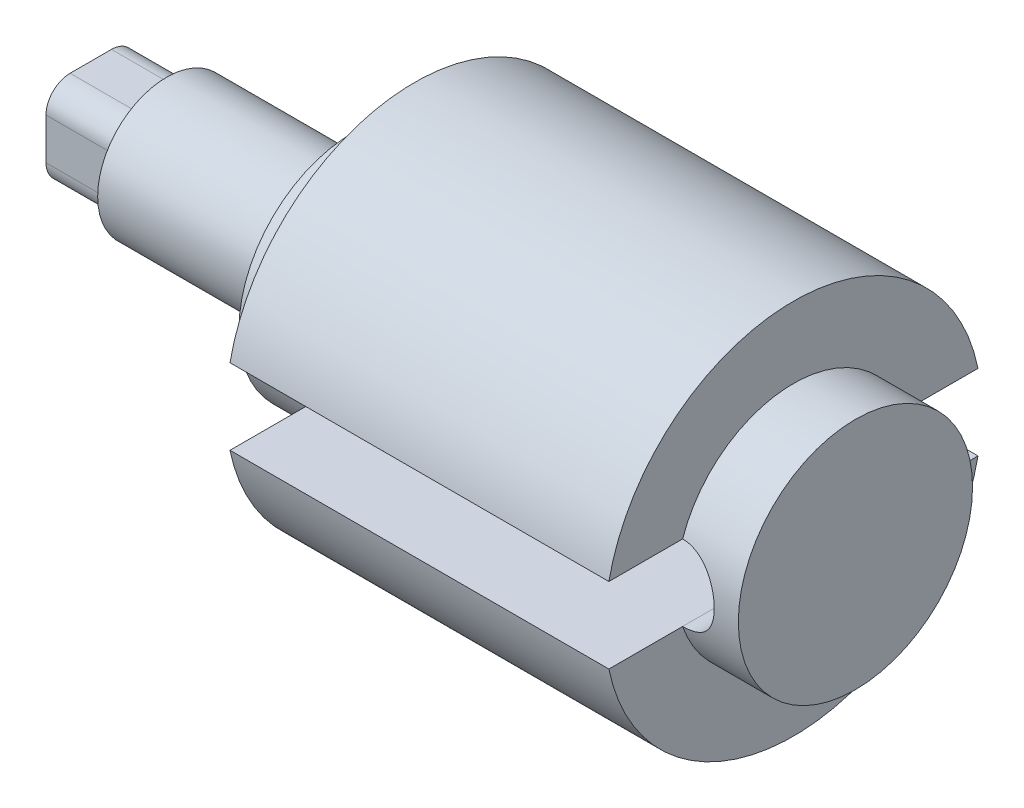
ISO-10303-21;
HEADER;
FILE_DESCRIPTION(('STEP AP214'),'2;1');
FILE_NAME('part.step','',(''),(''),'','','');
FILE_SCHEMA(('AUTOMOTIVE_DESIGN { 1 0 10303 214 1 1 1 1 }'));
ENDSEC;
DATA;
#1=APPLICATION_CONTEXT('core data for automotive mechanical design processes');
#2=APPLICATION_PROTOCOL_DEFINITION('international standard','automotive_design',2000,#1);
#3=PRODUCT_CONTEXT('',#1,'mechanical');
#4=PRODUCT('Part','Part','',(#3));
#5=PRODUCT_RELATED_PRODUCT_CATEGORY('part','',(#4));
#6=PRODUCT_DEFINITION_FORMATION('','',#4);
#7=PRODUCT_DEFINITION_CONTEXT('part definition',#1,'design');
#8=PRODUCT_DEFINITION('design','',#6,#7);
#9=PRODUCT_DEFINITION_SHAPE('','',#8);
#10=(LENGTH_UNIT() NAMED_UNIT(*) SI_UNIT(.MILLI.,.METRE.));
#11=(NAMED_UNIT(*) PLANE_ANGLE_UNIT() SI_UNIT($,.RADIAN.));
#12=(NAMED_UNIT(*) SI_UNIT($,.STERADIAN.) SOLID_ANGLE_UNIT());
#13=UNCERTAINTY_MEASURE_WITH_UNIT(LENGTH_MEASURE(1.E-05),#10,'distance_accuracy_value','');
#14=(GEOMETRIC_REPRESENTATION_CONTEXT(3) GLOBAL_UNCERTAINTY_ASSIGNED_CONTEXT((#13)) GLOBAL_UNIT_ASSIGNED_CONTEXT((#10,
#11,#12)) REPRESENTATION_CONTEXT('',''));
#15=CARTESIAN_POINT('',(0.,0.,0.));
#16=DIRECTION('',(0.,0.,1.));
#17=DIRECTION('',(1.,0.,0.));
#18=AXIS2_PLACEMENT_3D('',#15,#16,#17);
#19=CARTESIAN_POINT('',(0.,0.,0.));
#20=DIRECTION('',(-1.,0.,0.));
#21=DIRECTION('',(0.,0.,1.));
#22=AXIS2_PLACEMENT_3D('',#19,#20,#21);
#23=CYLINDRICAL_SURFACE('',#22,10.);
#24=CARTESIAN_POINT('',(38.,0.,0.));
#25=DIRECTION('',(-1.,0.,0.));
#26=DIRECTION('',(0.,0.,1.));
#27=AXIS2_PLACEMENT_3D('',#24,#25,#26);
#28=CIRCLE('',#27,10.);
#29=CARTESIAN_POINT('',(38.,0.,10.));
#30=VERTEX_POINT('',#29);
#31=EDGE_CURVE('E378',#30,#30,#28,.T.);
#32=ORIENTED_EDGE('',*,*,#31,.T.);
#33=EDGE_LOOP('',(#32));
#34=FACE_BOUND('',#33,.T.);
#35=CARTESIAN_POINT('',(11.,0.,0.));
#36=DIRECTION('',(-1.,0.,0.));
#37=DIRECTION('',(0.,0.,1.));
#38=AXIS2_PLACEMENT_3D('',#35,#36,#37);
#39=CIRCLE('',#38,10.);
#40=CARTESIAN_POINT('',(11.,0.,10.));
#41=VERTEX_POINT('',#40);
#42=EDGE_CURVE('E42',#41,#41,#39,.T.);
#43=ORIENTED_EDGE('',*,*,#42,.F.);
#44=EDGE_LOOP('',(#43));
#45=FACE_BOUND('',#44,.T.);
#46=ADVANCED_FACE('F38',(#34,#45),#23,.T.);
#47=CARTESIAN_POINT('',(47.,16.5,0.));
#48=DIRECTION('',(1.,0.,0.));
#49=DIRECTION('',(0.,0.,-1.));
#50=AXIS2_PLACEMENT_3D('',#47,#48,#49);
#51=PLANE('',#50);
#52=CARTESIAN_POINT('',(47.,0.,0.));
#53=DIRECTION('',(-1.,0.,0.));
#54=DIRECTION('',(0.,0.,1.));
#55=AXIS2_PLACEMENT_3D('',#52,#53,#54);
#56=CIRCLE('',#55,27.35);
#57=CARTESIAN_POINT('',(47.,5.5,26.79127656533));
#58=VERTEX_POINT('',#57);
#59=CARTESIAN_POINT('',(47.,5.5,-26.79127656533));
#60=VERTEX_POINT('',#59);
#61=EDGE_CURVE('E391',#58,#60,#56,.T.);
#62=ORIENTED_EDGE('',*,*,#61,.T.);
#63=DIRECTION('',(0.,0.,1.));
#64=VECTOR('',#63,1.);
#65=CARTESIAN_POINT('',(47.,5.5,-27.35));
#66=LINE('',#65,#64);
#67=CARTESIAN_POINT('',(47.,5.5,-15.556349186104));
#68=VERTEX_POINT('',#67);
#69=EDGE_CURVE('E235',#60,#68,#66,.T.);
#70=ORIENTED_EDGE('',*,*,#69,.T.);
#71=CARTESIAN_POINT('',(47.,0.,0.));
#72=DIRECTION('',(-1.,0.,0.));
#73=DIRECTION('',(0.,0.,1.));
#74=AXIS2_PLACEMENT_3D('',#71,#72,#73);
#75=CIRCLE('',#74,16.5);
#76=CARTESIAN_POINT('',(47.,5.5,15.556349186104));
#77=VERTEX_POINT('',#76);
#78=EDGE_CURVE('E382',#77,#68,#75,.T.);
#79=ORIENTED_EDGE('',*,*,#78,.F.);
#80=EDGE_CURVE('E230',#77,#58,#66,.T.);
#81=ORIENTED_EDGE('',*,*,#80,.T.);
#82=EDGE_LOOP('',(#62,#70,#79,#81));
#83=FACE_BOUND('',#82,.T.);
#84=ADVANCED_FACE('F356',(#83),#51,.F.);
#85=CARTESIAN_POINT('',(0.,0.,0.));
#86=DIRECTION('',(-1.,0.,0.));
#87=DIRECTION('',(0.,0.,1.));
#88=AXIS2_PLACEMENT_3D('',#85,#86,#87);
#89=CYLINDRICAL_SURFACE('',#88,27.35);
#90=CARTESIAN_POINT('',(102.,0.,0.));
#91=DIRECTION('',(-1.,0.,0.));
#92=DIRECTION('',(0.,0.,1.));
#93=AXIS2_PLACEMENT_3D('',#90,#91,#92);
#94=CIRCLE('',#93,27.35);
#95=CARTESIAN_POINT('',(102.,-5.5,-26.79127656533));
#96=VERTEX_POINT('',#95);
#97=CARTESIAN_POINT('',(102.,-5.5,26.79127656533));
#98=VERTEX_POINT('',#97);
#99=EDGE_CURVE('E393',#96,#98,#94,.T.);
#100=ORIENTED_EDGE('',*,*,#99,.T.);
#101=DIRECTION('',(-1.,0.,0.));
#102=VECTOR('',#101,1.);
#103=CARTESIAN_POINT('',(0.,-5.5,26.79127656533));
#104=LINE('',#103,#102);
#105=CARTESIAN_POINT('',(47.,-5.5,26.79127656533));
#106=VERTEX_POINT('',#105);
#107=EDGE_CURVE('E250',#98,#106,#104,.T.);
#108=ORIENTED_EDGE('',*,*,#107,.T.);
#109=CARTESIAN_POINT('',(47.,-5.5,-26.79127656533));
#110=VERTEX_POINT('',#109);
#111=EDGE_CURVE('E388',#110,#106,#56,.T.);
#112=ORIENTED_EDGE('',*,*,#111,.F.);
#113=DIRECTION('',(-1.,0.,0.));
#114=VECTOR('',#113,1.);
#115=CARTESIAN_POINT('',(0.,-5.5,-26.79127656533));
#116=LINE('',#115,#114);
#117=EDGE_CURVE('E247',#110,#96,#116,.F.);
#118=ORIENTED_EDGE('',*,*,#117,.T.);
#119=EDGE_LOOP('',(#100,#108,#112,#118));
#120=FACE_BOUND('',#119,.T.);
#121=ADVANCED_FACE('F361',(#120),#89,.T.);
#122=CARTESIAN_POINT('',(102.,27.35,0.));
#123=DIRECTION('',(-1.,0.,0.));
#124=DIRECTION('',(0.,0.,1.));
#125=AXIS2_PLACEMENT_3D('',#122,#123,#124);
#126=PLANE('',#125);
#127=CARTESIAN_POINT('',(102.,5.5,26.79127656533));
#128=VERTEX_POINT('',#127);
#129=CARTESIAN_POINT('',(102.,5.5,-26.79127656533));
#130=VERTEX_POINT('',#129);
#131=EDGE_CURVE('E392',#128,#130,#94,.T.);
#132=ORIENTED_EDGE('',*,*,#131,.F.);
#133=DIRECTION('',(0.,0.,1.));
#134=VECTOR('',#133,1.);
#135=CARTESIAN_POINT('',(102.,5.5,-27.35));
#136=LINE('',#135,#134);
#137=CARTESIAN_POINT('',(102.,5.5,16.0857079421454));
#138=VERTEX_POINT('',#137);
#139=EDGE_CURVE('E236',#138,#128,#136,.T.);
#140=ORIENTED_EDGE('',*,*,#139,.F.);
#141=CARTESIAN_POINT('',(102.,0.,0.));
#142=DIRECTION('',(-1.,0.,0.));
#143=DIRECTION('',(0.,0.,1.));
#144=AXIS2_PLACEMENT_3D('',#141,#142,#143);
#145=CIRCLE('',#144,17.);
#146=CARTESIAN_POINT('',(102.,5.5,-16.0857079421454));
#147=VERTEX_POINT('',#146);
#148=EDGE_CURVE('E396',#138,#147,#145,.T.);
#149=ORIENTED_EDGE('',*,*,#148,.T.);
#150=EDGE_CURVE('E234',#130,#147,#136,.T.);
#151=ORIENTED_EDGE('',*,*,#150,.F.);
#152=EDGE_LOOP('',(#132,#140,#149,#151));
#153=FACE_BOUND('',#152,.T.);
#154=ADVANCED_FACE('F368',(#153),#126,.F.);
#155=CARTESIAN_POINT('',(38.,10.,0.));
#156=DIRECTION('',(1.,0.,0.));
#157=DIRECTION('',(0.,0.,-1.));
#158=AXIS2_PLACEMENT_3D('',#155,#156,#157);
#159=PLANE('',#158);
#160=ORIENTED_EDGE('',*,*,#31,.F.);
#161=EDGE_LOOP('',(#160));
#162=FACE_BOUND('',#161,.T.);
#163=CARTESIAN_POINT('',(38.,0.,0.));
#164=DIRECTION('',(-1.,0.,0.));
#165=DIRECTION('',(0.,0.,1.));
#166=AXIS2_PLACEMENT_3D('',#163,#164,#165);
#167=CIRCLE('',#166,16.5);
#168=CARTESIAN_POINT('',(38.,0.,16.5));
#169=VERTEX_POINT('',#168);
#170=EDGE_CURVE('E381',#169,#169,#167,.T.);
#171=ORIENTED_EDGE('',*,*,#170,.T.);
#172=EDGE_LOOP('',(#171));
#173=FACE_BOUND('',#172,.T.);
#174=ADVANCED_FACE('F366',(#162,#173),#159,.F.);
#175=CARTESIAN_POINT('',(0.,0.,0.));
#176=DIRECTION('',(-1.,0.,0.));
#177=DIRECTION('',(0.,0.,1.));
#178=AXIS2_PLACEMENT_3D('',#175,#176,#177);
#179=CYLINDRICAL_SURFACE('',#178,16.5);
#180=ORIENTED_EDGE('',*,*,#170,.F.);
#181=EDGE_LOOP('',(#180));
#182=FACE_BOUND('',#181,.T.);
#183=CARTESIAN_POINT('',(47.,-5.5,-15.556349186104));
#184=VERTEX_POINT('',#183);
#185=CARTESIAN_POINT('',(47.,-5.5,15.556349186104));
#186=VERTEX_POINT('',#185);
#187=EDGE_CURVE('E385',#184,#186,#75,.T.);
#188=ORIENTED_EDGE('',*,*,#187,.T.);
#189=CARTESIAN_POINT('',(47.,-5.5,15.556349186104));
#190=CARTESIAN_POINT('',(46.8499471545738,-5.50002133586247,15.5563245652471));
#191=CARTESIAN_POINT('',(46.6999035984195,-5.49386029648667,15.5585194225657));
#192=CARTESIAN_POINT('',(46.4009803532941,-5.46933222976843,15.5671678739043));
#193=CARTESIAN_POINT('',(46.252100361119,-5.45096849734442,15.5736203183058));
#194=CARTESIAN_POINT('',(45.9570036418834,-5.40226565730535,15.5905788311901));
#195=CARTESIAN_POINT('',(45.810780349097,-5.37196206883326,15.6010728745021));
#196=CARTESIAN_POINT('',(45.5215723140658,-5.29966656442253,15.625780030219));
#197=CARTESIAN_POINT('',(45.3785876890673,-5.25767422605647,15.6399932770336));
#198=CARTESIAN_POINT('',(45.0969372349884,-5.16240616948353,15.6716966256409));
#199=CARTESIAN_POINT('',(44.9582680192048,-5.10913956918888,15.6891840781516));
#200=CARTESIAN_POINT('',(44.685956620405,-4.99171292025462,15.7269388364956));
#201=CARTESIAN_POINT('',(44.5523163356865,-4.92754880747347,15.747207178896));
#202=CARTESIAN_POINT('',(44.2908943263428,-4.78880460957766,15.7899530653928));
#203=CARTESIAN_POINT('',(44.1631138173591,-4.71422237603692,15.812431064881));
#204=CARTESIAN_POINT('',(43.9141333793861,-4.55513570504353,15.8589913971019));
#205=CARTESIAN_POINT('',(43.7929358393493,-4.47062770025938,15.8830743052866));
#206=CARTESIAN_POINT('',(43.5537162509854,-4.28910907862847,15.9330697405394));
#207=CARTESIAN_POINT('',(43.4359555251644,-4.19176342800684,15.9590168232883));
#208=CARTESIAN_POINT('',(43.2089734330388,-3.98765769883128,16.0112360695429));
#209=CARTESIAN_POINT('',(43.0997522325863,-3.88089743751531,16.0375082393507));
#210=CARTESIAN_POINT('',(42.890483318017,-3.65857691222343,16.0896815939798));
#211=CARTESIAN_POINT('',(42.7904388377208,-3.5430135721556,16.1155826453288));
#212=CARTESIAN_POINT('',(42.6002437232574,-3.30385821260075,16.1663061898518));
#213=CARTESIAN_POINT('',(42.5100896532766,-3.18026900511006,16.1911290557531));
#214=CARTESIAN_POINT('',(42.337993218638,-2.92238855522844,16.2396831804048));
#215=CARTESIAN_POINT('',(42.2563326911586,-2.78790020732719,16.263367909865));
#216=CARTESIAN_POINT('',(42.1047126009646,-2.51215188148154,16.3082370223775));
#217=CARTESIAN_POINT('',(42.0347483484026,-2.37089464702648,16.329422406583));
#218=CARTESIAN_POINT('',(41.9070589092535,-2.08250391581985,16.3687004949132));
#219=CARTESIAN_POINT('',(41.8493358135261,-1.93536942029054,16.3867926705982));
#220=CARTESIAN_POINT('',(41.7466927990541,-1.636377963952,16.4193442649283));
#221=CARTESIAN_POINT('',(41.7017671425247,-1.48452315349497,16.4338053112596));
#222=CARTESIAN_POINT('',(41.6264416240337,-1.18247918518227,16.4582473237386));
#223=CARTESIAN_POINT('',(41.595595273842,-1.03241240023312,16.4683652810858));
#224=CARTESIAN_POINT('',(41.5465206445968,-0.730072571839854,16.4845351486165));
#225=CARTESIAN_POINT('',(41.5282871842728,-0.577800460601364,16.4905887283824));
#226=CARTESIAN_POINT('',(41.504599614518,-0.272157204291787,16.4984635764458));
#227=CARTESIAN_POINT('',(41.4991454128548,-0.118786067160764,16.5002848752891));
#228=CARTESIAN_POINT('',(41.5010714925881,0.187864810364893,16.4996428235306));
#229=CARTESIAN_POINT('',(41.5084514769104,0.341144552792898,16.4971795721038));
#230=CARTESIAN_POINT('',(41.5354262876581,0.640396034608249,16.4882204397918));
#231=CARTESIAN_POINT('',(41.5545276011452,0.786417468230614,16.4818875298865));
#232=CARTESIAN_POINT('',(41.6043348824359,1.07630563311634,16.465498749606));
#233=CARTESIAN_POINT('',(41.6350447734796,1.2201716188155,16.4554416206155));
#234=CARTESIAN_POINT('',(41.7077860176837,1.50466680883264,16.4318698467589));
#235=CARTESIAN_POINT('',(41.7498135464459,1.64529708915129,16.4183563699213));
#236=CARTESIAN_POINT('',(41.8448610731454,1.92250387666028,16.3882099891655));
#237=CARTESIAN_POINT('',(41.8978852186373,2.05907883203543,16.3715759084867));
#238=CARTESIAN_POINT('',(42.0152454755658,2.32898122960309,16.3353794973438));
#239=CARTESIAN_POINT('',(42.0797173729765,2.46224494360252,16.3157824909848));
#240=CARTESIAN_POINT('',(42.2190400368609,2.72291582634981,16.2743096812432));
#241=CARTESIAN_POINT('',(42.2938943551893,2.85032097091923,16.2524330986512));
#242=CARTESIAN_POINT('',(42.4534491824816,3.0984896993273,16.206951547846));
#243=CARTESIAN_POINT('',(42.5381501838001,3.21925295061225,16.1833464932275));
#244=CARTESIAN_POINT('',(42.7168497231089,3.45345065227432,16.1349923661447));
#245=CARTESIAN_POINT('',(42.8108485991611,3.56688483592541,16.110243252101));
#246=CARTESIAN_POINT('',(43.0122213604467,3.79095881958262,16.0590303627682));
#247=CARTESIAN_POINT('',(43.1200171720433,3.90121389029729,16.0325407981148));
#248=CARTESIAN_POINT('',(43.3444623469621,4.11227043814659,15.9797079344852));
#249=CARTESIAN_POINT('',(43.4611089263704,4.21307486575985,15.9533645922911));
#250=CARTESIAN_POINT('',(43.7026557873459,4.40469091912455,15.901526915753));
#251=CARTESIAN_POINT('',(43.8275617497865,4.49549555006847,15.8760331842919));
#252=CARTESIAN_POINT('',(44.0847386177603,4.66637724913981,15.8266494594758));
#253=CARTESIAN_POINT('',(44.2170066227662,4.74645850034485,15.8027588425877));
#254=CARTESIAN_POINT('',(44.4901950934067,4.89648149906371,15.7569260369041));
#255=CARTESIAN_POINT('',(44.6312167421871,4.96625001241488,15.7350191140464));
#256=CARTESIAN_POINT('',(44.9190362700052,5.09355872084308,15.694270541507));
#257=CARTESIAN_POINT('',(45.0658317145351,5.15110400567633,15.6754276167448));
#258=CARTESIAN_POINT('',(45.3640459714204,5.2534251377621,15.6414332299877));
#259=CARTESIAN_POINT('',(45.5154595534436,5.29821487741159,15.6262777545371));
#260=CARTESIAN_POINT('',(45.8218568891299,5.37465335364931,15.6001514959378));
#261=CARTESIAN_POINT('',(45.976838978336,5.40630809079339,15.5891788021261));
#262=CARTESIAN_POINT('',(46.276258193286,5.45410185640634,15.5725203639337));
#263=CARTESIAN_POINT('',(46.4205055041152,5.4713088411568,15.5664719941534));
#264=CARTESIAN_POINT('',(46.7098315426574,5.49425937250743,15.5583784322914));
#265=CARTESIAN_POINT('',(46.8549089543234,5.50001771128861,15.5563280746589));
#266=CARTESIAN_POINT('',(47.,5.5,15.556349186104));
#267=B_SPLINE_CURVE_WITH_KNOTS('',3,(#189,#190,#191,#192,#193,#194,#195,#196,#197,#198,#199,
#200,#201,#202,#203,#204,#205,#206,#207,#208,#209,#210,#211,#212,#213,#214,#215,#216,#217,#218,
#219,#220,#221,#222,#223,#224,#225,#226,#227,#228,#229,#230,#231,#232,#233,#234,#235,#236,#237,
#238,#239,#240,#241,#242,#243,#244,#245,#246,#247,#248,#249,#250,#251,#252,#253,#254,#255,#256,
#257,#258,#259,#260,#261,#262,#263,#264,#265,#266),.UNSPECIFIED.,.F.,.F.,(4,2,2,2,2,2,2,2,2,2,2,
2,2,2,2,2,2,2,2,2,2,2,2,2,2,2,2,2,2,2,2,2,2,2,2,2,2,2,4),(0.,0.450001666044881,
0.899881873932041,1.34843374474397,1.79700182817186,2.2452085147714,2.69358272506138,
3.14204953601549,3.59067802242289,4.05507433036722,4.51947965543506,4.98404801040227,
5.44845446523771,5.92520043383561,6.40175478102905,6.87839046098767,7.3548121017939,
7.81484633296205,8.27469147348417,8.73453329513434,9.19436447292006,9.63604985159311,
10.0778846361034,10.5195703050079,10.9614228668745,11.4089169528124,11.8565645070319,
12.3042344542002,12.7519206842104,13.2207417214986,13.6894159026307,14.158415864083,
14.627232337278,15.1031976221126,15.5789643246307,16.0542108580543,16.5292400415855,
16.9649240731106,17.4000448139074),.UNSPECIFIED.);
#268=EDGE_CURVE('E267',#186,#77,#267,.T.);
#269=ORIENTED_EDGE('',*,*,#268,.T.);
#270=ORIENTED_EDGE('',*,*,#78,.T.);
#271=CARTESIAN_POINT('',(47.,5.5,-15.556349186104));
#272=CARTESIAN_POINT('',(46.8499471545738,5.50002133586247,-15.5563245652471));
#273=CARTESIAN_POINT('',(46.6999035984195,5.49386029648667,-15.5585194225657));
#274=CARTESIAN_POINT('',(46.4009803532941,5.46933222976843,-15.5671678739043));
#275=CARTESIAN_POINT('',(46.252100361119,5.45096849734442,-15.5736203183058));
#276=CARTESIAN_POINT('',(45.9570036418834,5.40226565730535,-15.5905788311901));
#277=CARTESIAN_POINT('',(45.810780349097,5.37196206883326,-15.6010728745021));
#278=CARTESIAN_POINT('',(45.5215723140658,5.29966656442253,-15.625780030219));
#279=CARTESIAN_POINT('',(45.3785876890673,5.25767422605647,-15.6399932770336));
#280=CARTESIAN_POINT('',(45.0969372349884,5.16240616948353,-15.6716966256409));
#281=CARTESIAN_POINT('',(44.9582680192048,5.10913956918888,-15.6891840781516));
#282=CARTESIAN_POINT('',(44.685956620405,4.99171292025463,-15.7269388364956));
#283=CARTESIAN_POINT('',(44.5523163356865,4.92754880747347,-15.747207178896));
#284=CARTESIAN_POINT('',(44.2908943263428,4.78880460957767,-15.7899530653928));
#285=CARTESIAN_POINT('',(44.1631138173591,4.71422237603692,-15.812431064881));
#286=CARTESIAN_POINT('',(43.9141333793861,4.55513570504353,-15.8589913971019));
#287=CARTESIAN_POINT('',(43.7929358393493,4.47062770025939,-15.8830743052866));
#288=CARTESIAN_POINT('',(43.5537162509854,4.28910907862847,-15.9330697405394));
#289=CARTESIAN_POINT('',(43.4359555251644,4.19176342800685,-15.9590168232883));
#290=CARTESIAN_POINT('',(43.2089734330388,3.98765769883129,-16.0112360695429));
#291=CARTESIAN_POINT('',(43.0997522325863,3.88089743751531,-16.0375082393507));
#292=CARTESIAN_POINT('',(42.890483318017,3.65857691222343,-16.0896815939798));
#293=CARTESIAN_POINT('',(42.7904388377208,3.5430135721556,-16.1155826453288));
#294=CARTESIAN_POINT('',(42.6002437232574,3.30385821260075,-16.1663061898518));
#295=CARTESIAN_POINT('',(42.5100896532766,3.18026900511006,-16.1911290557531));
#296=CARTESIAN_POINT('',(42.337993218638,2.92238855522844,-16.2396831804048));
#297=CARTESIAN_POINT('',(42.2563326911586,2.7879002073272,-16.263367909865));
#298=CARTESIAN_POINT('',(42.1047126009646,2.51215188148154,-16.3082370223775));
#299=CARTESIAN_POINT('',(42.0347483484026,2.37089464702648,-16.329422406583));
#300=CARTESIAN_POINT('',(41.9070589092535,2.08250391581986,-16.3687004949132));
#301=CARTESIAN_POINT('',(41.8493358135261,1.93536942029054,-16.3867926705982));
#302=CARTESIAN_POINT('',(41.7466927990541,1.636377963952,-16.4193442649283));
#303=CARTESIAN_POINT('',(41.7017671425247,1.48452315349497,-16.4338053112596));
#304=CARTESIAN_POINT('',(41.6264416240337,1.18247918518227,-16.4582473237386));
#305=CARTESIAN_POINT('',(41.595595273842,1.03241240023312,-16.4683652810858));
#306=CARTESIAN_POINT('',(41.5465206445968,0.730072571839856,-16.4845351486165));
#307=CARTESIAN_POINT('',(41.5282871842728,0.577800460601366,-16.4905887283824));
#308=CARTESIAN_POINT('',(41.504599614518,0.272157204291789,-16.4984635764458));
#309=CARTESIAN_POINT('',(41.4991454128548,0.118786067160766,-16.5002848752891));
#310=CARTESIAN_POINT('',(41.5010714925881,-0.187864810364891,-16.4996428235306));
#311=CARTESIAN_POINT('',(41.5084514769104,-0.341144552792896,-16.4971795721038));
#312=CARTESIAN_POINT('',(41.5354262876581,-0.640396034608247,-16.4882204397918));
#313=CARTESIAN_POINT('',(41.5545276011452,-0.786417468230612,-16.4818875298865));
#314=CARTESIAN_POINT('',(41.6043348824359,-1.07630563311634,-16.465498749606));
#315=CARTESIAN_POINT('',(41.6350447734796,-1.2201716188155,-16.4554416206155));
#316=CARTESIAN_POINT('',(41.7077860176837,-1.50466680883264,-16.4318698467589));
#317=CARTESIAN_POINT('',(41.7498135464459,-1.64529708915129,-16.4183563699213));
#318=CARTESIAN_POINT('',(41.8448610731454,-1.92250387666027,-16.3882099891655));
#319=CARTESIAN_POINT('',(41.8978852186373,-2.05907883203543,-16.3715759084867));
#320=CARTESIAN_POINT('',(42.0152454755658,-2.32898122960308,-16.3353794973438));
#321=CARTESIAN_POINT('',(42.0797173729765,-2.46224494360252,-16.3157824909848));
#322=CARTESIAN_POINT('',(42.2190400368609,-2.72291582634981,-16.2743096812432));
#323=CARTESIAN_POINT('',(42.2938943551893,-2.85032097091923,-16.2524330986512));
#324=CARTESIAN_POINT('',(42.4534491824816,-3.09848969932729,-16.206951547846));
#325=CARTESIAN_POINT('',(42.5381501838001,-3.21925295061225,-16.1833464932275));
#326=CARTESIAN_POINT('',(42.7168497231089,-3.45345065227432,-16.1349923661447));
#327=CARTESIAN_POINT('',(42.8108485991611,-3.56688483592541,-16.110243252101));
#328=CARTESIAN_POINT('',(43.0122213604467,-3.79095881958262,-16.0590303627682));
#329=CARTESIAN_POINT('',(43.1200171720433,-3.90121389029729,-16.0325407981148));
#330=CARTESIAN_POINT('',(43.3444623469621,-4.11227043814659,-15.9797079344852));
#331=CARTESIAN_POINT('',(43.4611089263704,-4.21307486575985,-15.9533645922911));
#332=CARTESIAN_POINT('',(43.7026557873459,-4.40469091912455,-15.901526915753));
#333=CARTESIAN_POINT('',(43.8275617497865,-4.49549555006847,-15.8760331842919));
#334=CARTESIAN_POINT('',(44.0847386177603,-4.66637724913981,-15.8266494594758));
#335=CARTESIAN_POINT('',(44.2170066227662,-4.74645850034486,-15.8027588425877));
#336=CARTESIAN_POINT('',(44.4901950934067,-4.89648149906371,-15.7569260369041));
#337=CARTESIAN_POINT('',(44.6312167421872,-4.96625001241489,-15.7350191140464));
#338=CARTESIAN_POINT('',(44.9190362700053,-5.09355872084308,-15.694270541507));
#339=CARTESIAN_POINT('',(45.0658317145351,-5.15110400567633,-15.6754276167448));
#340=CARTESIAN_POINT('',(45.3640459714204,-5.25342513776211,-15.6414332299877));
#341=CARTESIAN_POINT('',(45.5154595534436,-5.29821487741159,-15.6262777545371));
#342=CARTESIAN_POINT('',(45.8218568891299,-5.37465335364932,-15.6001514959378));
#343=CARTESIAN_POINT('',(45.976838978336,-5.40630809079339,-15.5891788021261));
#344=CARTESIAN_POINT('',(46.276258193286,-5.45410185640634,-15.5725203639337));
#345=CARTESIAN_POINT('',(46.4205055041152,-5.4713088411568,-15.5664719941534));
#346=CARTESIAN_POINT('',(46.7098315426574,-5.49425937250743,-15.5583784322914));
#347=CARTESIAN_POINT('',(46.8549089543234,-5.5000177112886,-15.5563280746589));
#348=CARTESIAN_POINT('',(47.,-5.5,-15.556349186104));
#349=B_SPLINE_CURVE_WITH_KNOTS('',3,(#271,#272,#273,#274,#275,#276,#277,#278,#279,#280,#281,
#282,#283,#284,#285,#286,#287,#288,#289,#290,#291,#292,#293,#294,#295,#296,#297,#298,#299,#300,
#301,#302,#303,#304,#305,#306,#307,#308,#309,#310,#311,#312,#313,#314,#315,#316,#317,#318,#319,
#320,#321,#322,#323,#324,#325,#326,#327,#328,#329,#330,#331,#332,#333,#334,#335,#336,#337,#338,
#339,#340,#341,#342,#343,#344,#345,#346,#347,#348),.UNSPECIFIED.,.F.,.F.,(4,2,2,2,2,2,2,2,2,2,2,
2,2,2,2,2,2,2,2,2,2,2,2,2,2,2,2,2,2,2,2,2,2,2,2,2,2,2,4),(0.,0.450001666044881,
0.899881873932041,1.34843374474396,1.79700182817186,2.2452085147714,2.69358272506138,
3.14204953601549,3.59067802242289,4.05507433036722,4.51947965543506,4.98404801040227,
5.44845446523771,5.92520043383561,6.40175478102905,6.87839046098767,7.3548121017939,
7.81484633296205,8.27469147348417,8.73453329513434,9.19436447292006,9.63604985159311,
10.0778846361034,10.5195703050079,10.9614228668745,11.4089169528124,11.8565645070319,
12.3042344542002,12.7519206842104,13.2207417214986,13.6894159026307,14.158415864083,
14.627232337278,15.1031976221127,15.5789643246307,16.0542108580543,16.5292400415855,
16.9649240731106,17.4000448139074),.UNSPECIFIED.);
#350=EDGE_CURVE('E259',#68,#184,#349,.T.);
#351=ORIENTED_EDGE('',*,*,#350,.T.);
#352=EDGE_LOOP('',(#188,#269,#270,#351));
#353=FACE_BOUND('',#352,.T.);
#354=ADVANCED_FACE('F272',(#182,#353),#179,.T.);
#355=ORIENTED_EDGE('',*,*,#111,.T.);
#356=DIRECTION('',(0.,0.,1.));
#357=VECTOR('',#356,1.);
#358=CARTESIAN_POINT('',(47.,-5.5,-27.35));
#359=LINE('',#358,#357);
#360=EDGE_CURVE('E244',#186,#106,#359,.T.);
#361=ORIENTED_EDGE('',*,*,#360,.F.);
#362=ORIENTED_EDGE('',*,*,#187,.F.);
#363=EDGE_CURVE('E243',#110,#184,#359,.T.);
#364=ORIENTED_EDGE('',*,*,#363,.F.);
#365=EDGE_LOOP('',(#355,#361,#362,#364));
#366=FACE_BOUND('',#365,.T.);
#367=ADVANCED_FACE('F363',(#366),#51,.F.);
#368=ORIENTED_EDGE('',*,*,#131,.T.);
#369=DIRECTION('',(-1.,0.,0.));
#370=VECTOR('',#369,1.);
#371=CARTESIAN_POINT('',(0.,5.5,-26.79127656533));
#372=LINE('',#371,#370);
#373=EDGE_CURVE('E256',#130,#60,#372,.T.);
#374=ORIENTED_EDGE('',*,*,#373,.T.);
#375=ORIENTED_EDGE('',*,*,#61,.F.);
#376=DIRECTION('',(-1.,0.,0.));
#377=VECTOR('',#376,1.);
#378=CARTESIAN_POINT('',(0.,5.5,26.79127656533));
#379=LINE('',#378,#377);
#380=EDGE_CURVE('E253',#58,#128,#379,.F.);
#381=ORIENTED_EDGE('',*,*,#380,.T.);
#382=EDGE_LOOP('',(#368,#374,#375,#381));
#383=FACE_BOUND('',#382,.T.);
#384=ADVANCED_FACE('F420',(#383),#89,.T.);
#385=ORIENTED_EDGE('',*,*,#99,.F.);
#386=DIRECTION('',(0.,0.,1.));
#387=VECTOR('',#386,1.);
#388=CARTESIAN_POINT('',(102.,-5.5,-27.35));
#389=LINE('',#388,#387);
#390=CARTESIAN_POINT('',(102.,-5.5,-16.0857079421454));
#391=VERTEX_POINT('',#390);
#392=EDGE_CURVE('E239',#96,#391,#389,.T.);
#393=ORIENTED_EDGE('',*,*,#392,.T.);
#394=CARTESIAN_POINT('',(102.,-5.5,16.0857079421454));
#395=VERTEX_POINT('',#394);
#396=EDGE_CURVE('E398',#391,#395,#145,.T.);
#397=ORIENTED_EDGE('',*,*,#396,.T.);
#398=EDGE_CURVE('E240',#395,#98,#389,.T.);
#399=ORIENTED_EDGE('',*,*,#398,.T.);
#400=EDGE_LOOP('',(#385,#393,#397,#399));
#401=FACE_BOUND('',#400,.T.);
#402=ADVANCED_FACE('F294',(#401),#126,.F.);
#403=CARTESIAN_POINT('',(0.,0.,0.));
#404=DIRECTION('',(-1.,0.,0.));
#405=DIRECTION('',(0.,0.,1.));
#406=AXIS2_PLACEMENT_3D('',#403,#404,#405);
#407=CYLINDRICAL_SURFACE('',#406,17.);
#408=ORIENTED_EDGE('',*,*,#148,.F.);
#409=CARTESIAN_POINT('',(102.,5.5,16.0857079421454));
#410=CARTESIAN_POINT('',(102.150325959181,5.50002093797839,16.0856842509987));
#411=CARTESIAN_POINT('',(102.300642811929,5.49383785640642,16.087814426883));
#412=CARTESIAN_POINT('',(102.6001163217,5.46921979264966,16.0962090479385));
#413=CARTESIAN_POINT('',(102.749273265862,5.4507879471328,16.1024724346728));
#414=CARTESIAN_POINT('',(103.044945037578,5.4018974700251,16.1189368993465));
#415=CARTESIAN_POINT('',(103.191466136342,5.37147294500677,16.129126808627));
#416=CARTESIAN_POINT('',(103.481266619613,5.29888316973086,16.1531206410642));
#417=CARTESIAN_POINT('',(103.624545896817,5.25671753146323,16.1669246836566));
#418=CARTESIAN_POINT('',(103.906796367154,5.16103759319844,16.1977223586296));
#419=CARTESIAN_POINT('',(104.045770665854,5.10753170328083,16.2147136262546));
#420=CARTESIAN_POINT('',(104.318649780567,4.98958839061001,16.2513943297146));
#421=CARTESIAN_POINT('',(104.452552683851,4.92514689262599,16.2710847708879));
#422=CARTESIAN_POINT('',(104.845429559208,4.7160787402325,16.3333948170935));
#423=CARTESIAN_POINT('',(105.09570507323,4.55566293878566,16.3792685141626));
#424=CARTESIAN_POINT('',(105.574495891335,4.19125216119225,16.4763475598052));
#425=CARTESIAN_POINT('',(105.80201209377,3.98598648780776,16.5276794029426));
#426=CARTESIAN_POINT('',(106.220111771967,3.54033589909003,16.6288353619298));
#427=CARTESIAN_POINT('',(106.41068878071,3.29994484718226,16.678659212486));
#428=CARTESIAN_POINT('',(106.753921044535,2.78363811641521,16.7726494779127));
#429=CARTESIAN_POINT('',(106.905536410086,2.50699818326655,16.8166479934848));
#430=CARTESIAN_POINT('',(107.159687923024,1.93048524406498,16.8925308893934));
#431=CARTESIAN_POINT('',(107.262238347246,1.63061902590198,16.924418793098));
#432=CARTESIAN_POINT('',(107.411988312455,1.02663397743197,16.9715855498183));
#433=CARTESIAN_POINT('',(107.460898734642,0.722980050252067,16.9873765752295));
#434=CARTESIAN_POINT('',(107.507411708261,0.111385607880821,17.0023841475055));
#435=CARTESIAN_POINT('',(107.505025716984,-0.19655393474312,17.0016043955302));
#436=CARTESIAN_POINT('',(107.450118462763,-0.795887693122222,16.9839098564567));
#437=CARTESIAN_POINT('',(107.399454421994,-1.08747264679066,16.9675927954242));
#438=CARTESIAN_POINT('',(107.25248030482,-1.65775713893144,16.9213982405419));
#439=CARTESIAN_POINT('',(107.156167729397,-1.93645597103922,16.8915200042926));
#440=CARTESIAN_POINT('',(106.919530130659,-2.47719653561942,16.8207876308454));
#441=CARTESIAN_POINT('',(106.778659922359,-2.73898076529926,16.7797984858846));
#442=CARTESIAN_POINT('',(106.457212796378,-3.23585438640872,16.691104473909));
#443=CARTESIAN_POINT('',(106.276625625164,-3.47093686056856,16.6433978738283));
#444=CARTESIAN_POINT('',(105.975223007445,-3.80413707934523,16.5693195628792));
#445=CARTESIAN_POINT('',(105.867013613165,-3.91407691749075,16.5436318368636));
#446=CARTESIAN_POINT('',(105.641737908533,-4.12449575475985,16.4924295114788));
#447=CARTESIAN_POINT('',(105.524674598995,-4.22497793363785,16.4669148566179));
#448=CARTESIAN_POINT('',(105.282326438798,-4.41589799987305,16.4167477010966));
#449=CARTESIAN_POINT('',(105.157035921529,-4.50632884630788,16.3920958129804));
#450=CARTESIAN_POINT('',(104.899125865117,-4.67642152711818,16.3443837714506));
#451=CARTESIAN_POINT('',(104.766509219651,-4.75608757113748,16.3213229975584));
#452=CARTESIAN_POINT('',(104.492874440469,-4.90511773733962,16.2771602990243));
#453=CARTESIAN_POINT('',(104.351765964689,-4.9743254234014,16.2560896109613));
#454=CARTESIAN_POINT('',(104.063848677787,-5.10051191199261,16.2169400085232));
#455=CARTESIAN_POINT('',(103.91704225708,-5.15749577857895,16.198859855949));
#456=CARTESIAN_POINT('',(103.618883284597,-5.2587046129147,16.1662875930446));
#457=CARTESIAN_POINT('',(103.467535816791,-5.3029433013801,16.1517916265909));
#458=CARTESIAN_POINT('',(103.16134641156,-5.37830092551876,16.1268549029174));
#459=CARTESIAN_POINT('',(103.006506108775,-5.40942586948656,16.1164122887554));
#460=CARTESIAN_POINT('',(102.709922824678,-5.45584528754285,16.1007552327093));
#461=CARTESIAN_POINT('',(102.568397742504,-5.47240023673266,16.0951261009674));
#462=CARTESIAN_POINT('',(102.284585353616,-5.49447806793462,16.0875956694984));
#463=CARTESIAN_POINT('',(102.142299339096,-5.50001586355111,16.0856893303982));
#464=CARTESIAN_POINT('',(102.,-5.5,16.0857079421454));
#465=B_SPLINE_CURVE_WITH_KNOTS('',3,(#409,#410,#411,#412,#413,#414,#415,#416,#417,#418,#419,
#420,#421,#422,#423,#424,#425,#426,#427,#428,#429,#430,#431,#432,#433,#434,#435,#436,#437,#438,
#439,#440,#441,#442,#443,#444,#445,#446,#447,#448,#449,#450,#451,#452,#453,#454,#455,#456,#457,
#458,#459,#460,#461,#462,#463,#464),.UNSPECIFIED.,.F.,.F.,(4,2,2,2,2,2,2,2,2,2,2,2,2,2,2,2,2,2,
2,2,2,2,2,2,2,2,2,4),(0.,0.450821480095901,0.901527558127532,1.35096099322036,1.80040928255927,
2.24952541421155,2.69880928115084,3.59695681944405,4.52494155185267,5.45308860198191,
6.40390478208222,7.35444412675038,8.27369432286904,9.19273920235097,10.0777985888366,
10.9629064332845,11.8592926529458,12.7559105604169,13.2246159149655,13.6931631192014,
14.1620364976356,14.6307259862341,15.1058495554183,15.580775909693,16.0551890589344,
16.5293846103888,16.9567174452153,17.3834714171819),.UNSPECIFIED.);
#466=EDGE_CURVE('E12',#138,#395,#465,.T.);
#467=ORIENTED_EDGE('',*,*,#466,.T.);
#468=ORIENTED_EDGE('',*,*,#396,.F.);
#469=CARTESIAN_POINT('',(102.,-5.5,-16.0857079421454));
#470=CARTESIAN_POINT('',(102.150325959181,-5.50002093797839,-16.0856842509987));
#471=CARTESIAN_POINT('',(102.300642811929,-5.49383785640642,-16.087814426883));
#472=CARTESIAN_POINT('',(102.6001163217,-5.46921979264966,-16.0962090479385));
#473=CARTESIAN_POINT('',(102.749273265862,-5.4507879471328,-16.1024724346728));
#474=CARTESIAN_POINT('',(103.044945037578,-5.4018974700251,-16.1189368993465));
#475=CARTESIAN_POINT('',(103.191466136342,-5.37147294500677,-16.129126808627));
#476=CARTESIAN_POINT('',(103.481266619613,-5.29888316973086,-16.1531206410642));
#477=CARTESIAN_POINT('',(103.624545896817,-5.25671753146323,-16.1669246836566));
#478=CARTESIAN_POINT('',(103.906796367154,-5.16103759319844,-16.1977223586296));
#479=CARTESIAN_POINT('',(104.045770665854,-5.10753170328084,-16.2147136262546));
#480=CARTESIAN_POINT('',(104.318649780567,-4.98958839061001,-16.2513943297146));
#481=CARTESIAN_POINT('',(104.452552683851,-4.92514689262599,-16.2710847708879));
#482=CARTESIAN_POINT('',(104.845429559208,-4.7160787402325,-16.3333948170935));
#483=CARTESIAN_POINT('',(105.09570507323,-4.55566293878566,-16.3792685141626));
#484=CARTESIAN_POINT('',(105.574495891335,-4.19125216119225,-16.4763475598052));
#485=CARTESIAN_POINT('',(105.80201209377,-3.98598648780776,-16.5276794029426));
#486=CARTESIAN_POINT('',(106.220111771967,-3.54033589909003,-16.6288353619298));
#487=CARTESIAN_POINT('',(106.41068878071,-3.29994484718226,-16.678659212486));
#488=CARTESIAN_POINT('',(106.753921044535,-2.78363811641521,-16.7726494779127));
#489=CARTESIAN_POINT('',(106.905536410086,-2.50699818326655,-16.8166479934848));
#490=CARTESIAN_POINT('',(107.159687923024,-1.93048524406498,-16.8925308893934));
#491=CARTESIAN_POINT('',(107.262238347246,-1.63061902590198,-16.924418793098));
#492=CARTESIAN_POINT('',(107.411988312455,-1.02663397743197,-16.9715855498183));
#493=CARTESIAN_POINT('',(107.460898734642,-0.722980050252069,-16.9873765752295));
#494=CARTESIAN_POINT('',(107.507411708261,-0.111385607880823,-17.0023841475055));
#495=CARTESIAN_POINT('',(107.505025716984,0.196553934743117,-17.0016043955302));
#496=CARTESIAN_POINT('',(107.450118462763,0.79588769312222,-16.9839098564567));
#497=CARTESIAN_POINT('',(107.399454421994,1.08747264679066,-16.9675927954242));
#498=CARTESIAN_POINT('',(107.25248030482,1.65775713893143,-16.9213982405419));
#499=CARTESIAN_POINT('',(107.156167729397,1.93645597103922,-16.8915200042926));
#500=CARTESIAN_POINT('',(106.919530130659,2.47719653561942,-16.8207876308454));
#501=CARTESIAN_POINT('',(106.778659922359,2.73898076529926,-16.7797984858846));
#502=CARTESIAN_POINT('',(106.457212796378,3.23585438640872,-16.691104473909));
#503=CARTESIAN_POINT('',(106.276625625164,3.47093686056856,-16.6433978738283));
#504=CARTESIAN_POINT('',(105.975223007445,3.80413707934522,-16.5693195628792));
#505=CARTESIAN_POINT('',(105.867013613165,3.91407691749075,-16.5436318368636));
#506=CARTESIAN_POINT('',(105.641737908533,4.12449575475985,-16.4924295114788));
#507=CARTESIAN_POINT('',(105.524674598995,4.22497793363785,-16.4669148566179));
#508=CARTESIAN_POINT('',(105.282326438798,4.41589799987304,-16.4167477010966));
#509=CARTESIAN_POINT('',(105.157035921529,4.50632884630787,-16.3920958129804));
#510=CARTESIAN_POINT('',(104.899125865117,4.67642152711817,-16.3443837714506));
#511=CARTESIAN_POINT('',(104.766509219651,4.75608757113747,-16.3213229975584));
#512=CARTESIAN_POINT('',(104.492874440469,4.90511773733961,-16.2771602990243));
#513=CARTESIAN_POINT('',(104.351765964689,4.9743254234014,-16.2560896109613));
#514=CARTESIAN_POINT('',(104.063848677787,5.10051191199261,-16.2169400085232));
#515=CARTESIAN_POINT('',(103.91704225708,5.15749577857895,-16.198859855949));
#516=CARTESIAN_POINT('',(103.618883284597,5.2587046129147,-16.1662875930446));
#517=CARTESIAN_POINT('',(103.467535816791,5.3029433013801,-16.1517916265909));
#518=CARTESIAN_POINT('',(103.16134641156,5.37830092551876,-16.1268549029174));
#519=CARTESIAN_POINT('',(103.006506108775,5.40942586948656,-16.1164122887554));
#520=CARTESIAN_POINT('',(102.709922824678,5.45584528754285,-16.1007552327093));
#521=CARTESIAN_POINT('',(102.568397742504,5.47240023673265,-16.0951261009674));
#522=CARTESIAN_POINT('',(102.284585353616,5.49447806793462,-16.0875956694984));
#523=CARTESIAN_POINT('',(102.142299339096,5.50001586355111,-16.0856893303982));
#524=CARTESIAN_POINT('',(102.,5.5,-16.0857079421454));
#525=B_SPLINE_CURVE_WITH_KNOTS('',3,(#469,#470,#471,#472,#473,#474,#475,#476,#477,#478,#479,
#480,#481,#482,#483,#484,#485,#486,#487,#488,#489,#490,#491,#492,#493,#494,#495,#496,#497,#498,
#499,#500,#501,#502,#503,#504,#505,#506,#507,#508,#509,#510,#511,#512,#513,#514,#515,#516,#517,
#518,#519,#520,#521,#522,#523,#524),.UNSPECIFIED.,.F.,.F.,(4,2,2,2,2,2,2,2,2,2,2,2,2,2,2,2,2,2,
2,2,2,2,2,2,2,2,2,4),(0.,0.450821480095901,0.901527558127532,1.35096099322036,1.80040928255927,
2.24952541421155,2.69880928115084,3.59695681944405,4.52494155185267,5.45308860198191,
6.40390478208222,7.35444412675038,8.27369432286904,9.19273920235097,10.0777985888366,
10.9629064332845,11.8592926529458,12.7559105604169,13.2246159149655,13.6931631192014,
14.1620364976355,14.6307259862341,15.1058495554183,15.580775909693,16.0551890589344,
16.5293846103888,16.9567174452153,17.3834714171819),.UNSPECIFIED.);
#526=EDGE_CURVE('E47',#391,#147,#525,.T.);
#527=ORIENTED_EDGE('',*,*,#526,.T.);
#528=EDGE_LOOP('',(#408,#467,#468,#527));
#529=FACE_BOUND('',#528,.T.);
#530=CARTESIAN_POINT('',(111.,0.,0.));
#531=DIRECTION('',(-1.,0.,0.));
#532=DIRECTION('',(0.,0.,1.));
#533=AXIS2_PLACEMENT_3D('',#530,#531,#532);
#534=CIRCLE('',#533,17.);
#535=CARTESIAN_POINT('',(111.,0.,17.));
#536=VERTEX_POINT('',#535);
#537=EDGE_CURVE('E399',#536,#536,#534,.T.);
#538=ORIENTED_EDGE('',*,*,#537,.T.);
#539=EDGE_LOOP('',(#538));
#540=FACE_BOUND('',#539,.T.);
#541=ADVANCED_FACE('F289',(#529,#540),#407,.T.);
#542=CARTESIAN_POINT('',(111.,17.,0.));
#543=DIRECTION('',(-1.,0.,0.));
#544=DIRECTION('',(0.,0.,1.));
#545=AXIS2_PLACEMENT_3D('',#542,#543,#544);
#546=PLANE('',#545);
#547=ORIENTED_EDGE('',*,*,#537,.F.);
#548=EDGE_LOOP('',(#547));
#549=FACE_BOUND('',#548,.T.);
#550=ADVANCED_FACE('F282',(#549),#546,.F.);
#551=CARTESIAN_POINT('',(47.,0.,-27.35));
#552=DIRECTION('',(0.,0.,1.));
#553=DIRECTION('',(1.,0.,0.));
#554=AXIS2_PLACEMENT_3D('',#551,#552,#553);
#555=CYLINDRICAL_SURFACE('',#554,5.5);
#556=EDGE_CURVE('E246',#184,#186,#359,.T.);
#557=ORIENTED_EDGE('',*,*,#556,.F.);
#558=ORIENTED_EDGE('',*,*,#350,.F.);
#559=EDGE_CURVE('E233',#68,#77,#66,.T.);
#560=ORIENTED_EDGE('',*,*,#559,.T.);
#561=ORIENTED_EDGE('',*,*,#268,.F.);
#562=EDGE_LOOP('',(#557,#558,#560,#561));
#563=FACE_BOUND('',#562,.T.);
#564=ADVANCED_FACE('F276',(#563),#555,.F.);
#565=CARTESIAN_POINT('',(47.,5.5,-27.35));
#566=DIRECTION('',(0.,1.,0.));
#567=DIRECTION('',(-1.,0.,0.));
#568=AXIS2_PLACEMENT_3D('',#565,#566,#567);
#569=PLANE('',#568);
#570=ORIENTED_EDGE('',*,*,#150,.T.);
#571=EDGE_CURVE('E238',#147,#138,#136,.T.);
#572=ORIENTED_EDGE('',*,*,#571,.T.);
#573=ORIENTED_EDGE('',*,*,#139,.T.);
#574=ORIENTED_EDGE('',*,*,#380,.F.);
#575=ORIENTED_EDGE('',*,*,#80,.F.);
#576=ORIENTED_EDGE('',*,*,#559,.F.);
#577=ORIENTED_EDGE('',*,*,#69,.F.);
#578=ORIENTED_EDGE('',*,*,#373,.F.);
#579=EDGE_LOOP('',(#570,#572,#573,#574,#575,#576,#577,#578));
#580=FACE_BOUND('',#579,.T.);
#581=ADVANCED_FACE('F281',(#580),#569,.F.);
#582=CARTESIAN_POINT('',(47.,-5.5,-27.35));
#583=DIRECTION('',(0.,-1.,0.));
#584=DIRECTION('',(1.,0.,0.));
#585=AXIS2_PLACEMENT_3D('',#582,#583,#584);
#586=PLANE('',#585);
#587=ORIENTED_EDGE('',*,*,#398,.F.);
#588=EDGE_CURVE('E62',#391,#395,#389,.T.);
#589=ORIENTED_EDGE('',*,*,#588,.F.);
#590=ORIENTED_EDGE('',*,*,#392,.F.);
#591=ORIENTED_EDGE('',*,*,#117,.F.);
#592=ORIENTED_EDGE('',*,*,#363,.T.);
#593=ORIENTED_EDGE('',*,*,#556,.T.);
#594=ORIENTED_EDGE('',*,*,#360,.T.);
#595=ORIENTED_EDGE('',*,*,#107,.F.);
#596=EDGE_LOOP('',(#587,#589,#590,#591,#592,#593,#594,#595));
#597=FACE_BOUND('',#596,.T.);
#598=ADVANCED_FACE('F284',(#597),#586,.F.);
#599=CARTESIAN_POINT('',(102.,0.,-27.35));
#600=DIRECTION('',(0.,0.,1.));
#601=DIRECTION('',(1.,0.,0.));
#602=AXIS2_PLACEMENT_3D('',#599,#600,#601);
#603=CYLINDRICAL_SURFACE('',#602,5.5);
#604=ORIENTED_EDGE('',*,*,#571,.F.);
#605=ORIENTED_EDGE('',*,*,#526,.F.);
#606=ORIENTED_EDGE('',*,*,#588,.T.);
#607=ORIENTED_EDGE('',*,*,#466,.F.);
#608=EDGE_LOOP('',(#604,#605,#606,#607));
#609=FACE_BOUND('',#608,.T.);
#610=ADVANCED_FACE('F306',(#609),#603,.F.);
#611=CARTESIAN_POINT('',(11.,0.,0.));
#612=DIRECTION('',(-1.,0.,0.));
#613=DIRECTION('',(0.,0.,1.));
#614=AXIS2_PLACEMENT_3D('',#611,#612,#613);
#615=PLANE('',#614);
#616=DIRECTION('',(0.,0.,-1.));
#617=VECTOR('',#616,1.);
#618=CARTESIAN_POINT('',(11.,6.5,-2.99999999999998));
#619=LINE('',#618,#617);
#620=CARTESIAN_POINT('',(11.,6.5,2.99999999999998));
#621=VERTEX_POINT('',#620);
#622=CARTESIAN_POINT('',(11.,6.5,-2.99999999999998));
#623=VERTEX_POINT('',#622);
#624=EDGE_CURVE('E211',#621,#623,#619,.T.);
#625=ORIENTED_EDGE('',*,*,#624,.F.);
#626=CARTESIAN_POINT('',(11.,3.,3.));
#627=DIRECTION('',(-1.,0.,0.));
#628=DIRECTION('',(0.,0.,-1.));
#629=AXIS2_PLACEMENT_3D('',#626,#627,#628);
#630=CIRCLE('',#629,3.5);
#631=CARTESIAN_POINT('',(11.,2.99999999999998,6.5));
#632=VERTEX_POINT('',#631);
#633=EDGE_CURVE('E208',#632,#621,#630,.T.);
#634=ORIENTED_EDGE('',*,*,#633,.F.);
#635=DIRECTION('',(0.,1.,0.));
#636=VECTOR('',#635,1.);
#637=CARTESIAN_POINT('',(11.,2.99999999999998,6.5));
#638=LINE('',#637,#636);
#639=CARTESIAN_POINT('',(11.,-2.99999999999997,6.5));
#640=VERTEX_POINT('',#639);
#641=EDGE_CURVE('E205',#640,#632,#638,.T.);
#642=ORIENTED_EDGE('',*,*,#641,.F.);
#643=CARTESIAN_POINT('',(11.,-3.,3.));
#644=DIRECTION('',(-1.,0.,0.));
#645=DIRECTION('',(0.,0.,1.));
#646=AXIS2_PLACEMENT_3D('',#643,#644,#645);
#647=CIRCLE('',#646,3.5);
#648=CARTESIAN_POINT('',(11.,-6.5,2.99999999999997));
#649=VERTEX_POINT('',#648);
#650=EDGE_CURVE('E202',#649,#640,#647,.T.);
#651=ORIENTED_EDGE('',*,*,#650,.F.);
#652=DIRECTION('',(0.,0.,1.));
#653=VECTOR('',#652,1.);
#654=CARTESIAN_POINT('',(11.,-6.5,-2.99999999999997));
#655=LINE('',#654,#653);
#656=CARTESIAN_POINT('',(11.,-6.5,-2.99999999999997));
#657=VERTEX_POINT('',#656);
#658=EDGE_CURVE('E199',#657,#649,#655,.T.);
#659=ORIENTED_EDGE('',*,*,#658,.F.);
#660=CARTESIAN_POINT('',(11.,-3.,-3.));
#661=DIRECTION('',(-1.,0.,0.));
#662=DIRECTION('',(0.,0.,1.));
#663=AXIS2_PLACEMENT_3D('',#660,#661,#662);
#664=CIRCLE('',#663,3.5);
#665=CARTESIAN_POINT('',(11.,-2.99999999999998,-6.5));
#666=VERTEX_POINT('',#665);
#667=EDGE_CURVE('E196',#666,#657,#664,.T.);
#668=ORIENTED_EDGE('',*,*,#667,.F.);
#669=DIRECTION('',(0.,-1.,0.));
#670=VECTOR('',#669,1.);
#671=CARTESIAN_POINT('',(11.,2.99999999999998,-6.5));
#672=LINE('',#671,#670);
#673=CARTESIAN_POINT('',(11.,2.99999999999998,-6.5));
#674=VERTEX_POINT('',#673);
#675=EDGE_CURVE('E193',#674,#666,#672,.T.);
#676=ORIENTED_EDGE('',*,*,#675,.F.);
#677=CARTESIAN_POINT('',(11.,3.,-3.));
#678=DIRECTION('',(-1.,0.,0.));
#679=DIRECTION('',(0.,0.,1.));
#680=AXIS2_PLACEMENT_3D('',#677,#678,#679);
#681=CIRCLE('',#680,3.5);
#682=EDGE_CURVE('E190',#623,#674,#681,.T.);
#683=ORIENTED_EDGE('',*,*,#682,.F.);
#684=EDGE_LOOP('',(#625,#634,#642,#651,#659,#668,#676,#683));
#685=FACE_BOUND('',#684,.T.);
#686=ORIENTED_EDGE('',*,*,#42,.T.);
#687=EDGE_LOOP('',(#686));
#688=FACE_BOUND('',#687,.T.);
#689=ADVANCED_FACE('F310',(#685,#688),#615,.T.);
#690=CARTESIAN_POINT('',(11.,3.,-3.));
#691=DIRECTION('',(-1.,0.,0.));
#692=DIRECTION('',(0.,0.,1.));
#693=AXIS2_PLACEMENT_3D('',#690,#691,#692);
#694=CYLINDRICAL_SURFACE('',#693,3.5);
#695=CARTESIAN_POINT('',(0.,3.,-3.));
#696=DIRECTION('',(-1.,0.,0.));
#697=DIRECTION('',(0.,0.,1.));
#698=AXIS2_PLACEMENT_3D('',#695,#696,#697);
#699=CIRCLE('',#698,3.5);
#700=CARTESIAN_POINT('',(0.,6.5,-2.99999999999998));
#701=VERTEX_POINT('',#700);
#702=CARTESIAN_POINT('',(0.,2.99999999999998,-6.5));
#703=VERTEX_POINT('',#702);
#704=EDGE_CURVE('E166',#701,#703,#699,.T.);
#705=ORIENTED_EDGE('',*,*,#704,.F.);
#706=DIRECTION('',(-1.,0.,0.));
#707=VECTOR('',#706,1.);
#708=CARTESIAN_POINT('',(11.,6.5,-2.99999999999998));
#709=LINE('',#708,#707);
#710=EDGE_CURVE('E215',#623,#701,#709,.T.);
#711=ORIENTED_EDGE('',*,*,#710,.F.);
#712=ORIENTED_EDGE('',*,*,#682,.T.);
#713=DIRECTION('',(-1.,0.,0.));
#714=VECTOR('',#713,1.);
#715=CARTESIAN_POINT('',(11.,2.99999999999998,-6.5));
#716=LINE('',#715,#714);
#717=EDGE_CURVE('E214',#674,#703,#716,.T.);
#718=ORIENTED_EDGE('',*,*,#717,.T.);
#719=EDGE_LOOP('',(#705,#711,#712,#718));
#720=FACE_BOUND('',#719,.T.);
#721=ADVANCED_FACE('F317',(#720),#694,.T.);
#722=CARTESIAN_POINT('',(11.,6.5,-2.99999999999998));
#723=DIRECTION('',(0.,1.,0.));
#724=DIRECTION('',(0.,0.,1.));
#725=AXIS2_PLACEMENT_3D('',#722,#723,#724);
#726=PLANE('',#725);
#727=DIRECTION('',(0.,0.,-1.));
#728=VECTOR('',#727,1.);
#729=CARTESIAN_POINT('',(0.,6.5,-2.99999999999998));
#730=LINE('',#729,#728);
#731=CARTESIAN_POINT('',(0.,6.5,2.99999999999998));
#732=VERTEX_POINT('',#731);
#733=EDGE_CURVE('E187',#732,#701,#730,.T.);
#734=ORIENTED_EDGE('',*,*,#733,.F.);
#735=DIRECTION('',(-1.,0.,0.));
#736=VECTOR('',#735,1.);
#737=CARTESIAN_POINT('',(11.,6.5,2.99999999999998));
#738=LINE('',#737,#736);
#739=EDGE_CURVE('E217',#621,#732,#738,.T.);
#740=ORIENTED_EDGE('',*,*,#739,.F.);
#741=ORIENTED_EDGE('',*,*,#624,.T.);
#742=ORIENTED_EDGE('',*,*,#710,.T.);
#743=EDGE_LOOP('',(#734,#740,#741,#742));
#744=FACE_BOUND('',#743,.T.);
#745=ADVANCED_FACE('F321',(#744),#726,.T.);
#746=CARTESIAN_POINT('',(11.,3.,3.));
#747=DIRECTION('',(-1.,0.,0.));
#748=DIRECTION('',(0.,0.,1.));
#749=AXIS2_PLACEMENT_3D('',#746,#747,#748);
#750=CYLINDRICAL_SURFACE('',#749,3.5);
#751=CARTESIAN_POINT('',(0.,3.,3.));
#752=DIRECTION('',(-1.,0.,0.));
#753=DIRECTION('',(0.,0.,-1.));
#754=AXIS2_PLACEMENT_3D('',#751,#752,#753);
#755=CIRCLE('',#754,3.5);
#756=CARTESIAN_POINT('',(0.,2.99999999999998,6.5));
#757=VERTEX_POINT('',#756);
#758=EDGE_CURVE('E184',#757,#732,#755,.T.);
#759=ORIENTED_EDGE('',*,*,#758,.F.);
#760=DIRECTION('',(-1.,0.,0.));
#761=VECTOR('',#760,1.);
#762=CARTESIAN_POINT('',(11.,2.99999999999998,6.5));
#763=LINE('',#762,#761);
#764=EDGE_CURVE('E219',#632,#757,#763,.T.);
#765=ORIENTED_EDGE('',*,*,#764,.F.);
#766=ORIENTED_EDGE('',*,*,#633,.T.);
#767=ORIENTED_EDGE('',*,*,#739,.T.);
#768=EDGE_LOOP('',(#759,#765,#766,#767));
#769=FACE_BOUND('',#768,.T.);
#770=ADVANCED_FACE('F341',(#769),#750,.T.);
#771=CARTESIAN_POINT('',(11.,2.99999999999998,6.5));
#772=DIRECTION('',(0.,0.,1.));
#773=DIRECTION('',(0.,-1.,0.));
#774=AXIS2_PLACEMENT_3D('',#771,#772,#773);
#775=PLANE('',#774);
#776=DIRECTION('',(0.,1.,0.));
#777=VECTOR('',#776,1.);
#778=CARTESIAN_POINT('',(0.,2.99999999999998,6.5));
#779=LINE('',#778,#777);
#780=CARTESIAN_POINT('',(0.,-2.99999999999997,6.5));
#781=VERTEX_POINT('',#780);
#782=EDGE_CURVE('E181',#781,#757,#779,.T.);
#783=ORIENTED_EDGE('',*,*,#782,.F.);
#784=DIRECTION('',(-1.,0.,0.));
#785=VECTOR('',#784,1.);
#786=CARTESIAN_POINT('',(11.,-2.99999999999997,6.5));
#787=LINE('',#786,#785);
#788=EDGE_CURVE('E221',#640,#781,#787,.T.);
#789=ORIENTED_EDGE('',*,*,#788,.F.);
#790=ORIENTED_EDGE('',*,*,#641,.T.);
#791=ORIENTED_EDGE('',*,*,#764,.T.);
#792=EDGE_LOOP('',(#783,#789,#790,#791));
#793=FACE_BOUND('',#792,.T.);
#794=ADVANCED_FACE('F337',(#793),#775,.T.);
#795=CARTESIAN_POINT('',(11.,-3.,3.));
#796=DIRECTION('',(-1.,0.,0.));
#797=DIRECTION('',(0.,0.,1.));
#798=AXIS2_PLACEMENT_3D('',#795,#796,#797);
#799=CYLINDRICAL_SURFACE('',#798,3.5);
#800=CARTESIAN_POINT('',(0.,-3.,3.));
#801=DIRECTION('',(-1.,0.,0.));
#802=DIRECTION('',(0.,0.,1.));
#803=AXIS2_PLACEMENT_3D('',#800,#801,#802);
#804=CIRCLE('',#803,3.5);
#805=CARTESIAN_POINT('',(0.,-6.5,2.99999999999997));
#806=VERTEX_POINT('',#805);
#807=EDGE_CURVE('E178',#806,#781,#804,.T.);
#808=ORIENTED_EDGE('',*,*,#807,.F.);
#809=DIRECTION('',(-1.,0.,0.));
#810=VECTOR('',#809,1.);
#811=CARTESIAN_POINT('',(11.,-6.5,2.99999999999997));
#812=LINE('',#811,#810);
#813=EDGE_CURVE('E223',#649,#806,#812,.T.);
#814=ORIENTED_EDGE('',*,*,#813,.F.);
#815=ORIENTED_EDGE('',*,*,#650,.T.);
#816=ORIENTED_EDGE('',*,*,#788,.T.);
#817=EDGE_LOOP('',(#808,#814,#815,#816));
#818=FACE_BOUND('',#817,.T.);
#819=ADVANCED_FACE('F333',(#818),#799,.T.);
#820=CARTESIAN_POINT('',(11.,-6.5,-2.99999999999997));
#821=DIRECTION('',(0.,-1.,0.));
#822=DIRECTION('',(0.,0.,-1.));
#823=AXIS2_PLACEMENT_3D('',#820,#821,#822);
#824=PLANE('',#823);
#825=DIRECTION('',(0.,0.,1.));
#826=VECTOR('',#825,1.);
#827=CARTESIAN_POINT('',(0.,-6.5,-2.99999999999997));
#828=LINE('',#827,#826);
#829=CARTESIAN_POINT('',(0.,-6.5,-2.99999999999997));
#830=VERTEX_POINT('',#829);
#831=EDGE_CURVE('E175',#830,#806,#828,.T.);
#832=ORIENTED_EDGE('',*,*,#831,.F.);
#833=DIRECTION('',(-1.,0.,0.));
#834=VECTOR('',#833,1.);
#835=CARTESIAN_POINT('',(11.,-6.5,-2.99999999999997));
#836=LINE('',#835,#834);
#837=EDGE_CURVE('E225',#657,#830,#836,.T.);
#838=ORIENTED_EDGE('',*,*,#837,.F.);
#839=ORIENTED_EDGE('',*,*,#658,.T.);
#840=ORIENTED_EDGE('',*,*,#813,.T.);
#841=EDGE_LOOP('',(#832,#838,#839,#840));
#842=FACE_BOUND('',#841,.T.);
#843=ADVANCED_FACE('F330',(#842),#824,.T.);
#844=CARTESIAN_POINT('',(11.,-3.,-3.));
#845=DIRECTION('',(-1.,0.,0.));
#846=DIRECTION('',(0.,0.,1.));
#847=AXIS2_PLACEMENT_3D('',#844,#845,#846);
#848=CYLINDRICAL_SURFACE('',#847,3.5);
#849=CARTESIAN_POINT('',(0.,-3.,-3.));
#850=DIRECTION('',(-1.,0.,0.));
#851=DIRECTION('',(0.,0.,1.));
#852=AXIS2_PLACEMENT_3D('',#849,#850,#851);
#853=CIRCLE('',#852,3.5);
#854=CARTESIAN_POINT('',(0.,-2.99999999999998,-6.5));
#855=VERTEX_POINT('',#854);
#856=EDGE_CURVE('E54',#855,#830,#853,.T.);
#857=ORIENTED_EDGE('',*,*,#856,.F.);
#858=DIRECTION('',(-1.,0.,0.));
#859=VECTOR('',#858,1.);
#860=CARTESIAN_POINT('',(11.,-2.99999999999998,-6.5));
#861=LINE('',#860,#859);
#862=EDGE_CURVE('E227',#666,#855,#861,.T.);
#863=ORIENTED_EDGE('',*,*,#862,.F.);
#864=ORIENTED_EDGE('',*,*,#667,.T.);
#865=ORIENTED_EDGE('',*,*,#837,.T.);
#866=EDGE_LOOP('',(#857,#863,#864,#865));
#867=FACE_BOUND('',#866,.T.);
#868=ADVANCED_FACE('F326',(#867),#848,.T.);
#869=CARTESIAN_POINT('',(11.,2.99999999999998,-6.5));
#870=DIRECTION('',(0.,0.,-1.));
#871=DIRECTION('',(0.,1.,0.));
#872=AXIS2_PLACEMENT_3D('',#869,#870,#871);
#873=PLANE('',#872);
#874=DIRECTION('',(0.,-1.,0.));
#875=VECTOR('',#874,1.);
#876=CARTESIAN_POINT('',(0.,2.99999999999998,-6.5));
#877=LINE('',#876,#875);
#878=EDGE_CURVE('E171',#703,#855,#877,.T.);
#879=ORIENTED_EDGE('',*,*,#878,.F.);
#880=ORIENTED_EDGE('',*,*,#717,.F.);
#881=ORIENTED_EDGE('',*,*,#675,.T.);
#882=ORIENTED_EDGE('',*,*,#862,.T.);
#883=EDGE_LOOP('',(#879,#880,#881,#882));
#884=FACE_BOUND('',#883,.T.);
#885=ADVANCED_FACE('F323',(#884),#873,.T.);
#886=CARTESIAN_POINT('',(0.,0.,0.));
#887=DIRECTION('',(1.,0.,0.));
#888=DIRECTION('',(0.,0.,-1.));
#889=AXIS2_PLACEMENT_3D('',#886,#887,#888);
#890=PLANE('',#889);
#891=CARTESIAN_POINT('',(0.,0.,0.));
#892=DIRECTION('',(-1.,0.,0.));
#893=DIRECTION('',(0.,0.,1.));
#894=AXIS2_PLACEMENT_3D('',#891,#892,#893);
#895=CIRCLE('',#894,2.49999999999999);
#896=CARTESIAN_POINT('',(0.,0.,2.49999999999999));
#897=VERTEX_POINT('',#896);
#898=EDGE_CURVE('E163',#897,#897,#895,.T.);
#899=ORIENTED_EDGE('',*,*,#898,.F.);
#900=EDGE_LOOP('',(#899));
#901=FACE_BOUND('',#900,.T.);
#902=ORIENTED_EDGE('',*,*,#704,.T.);
#903=ORIENTED_EDGE('',*,*,#878,.T.);
#904=ORIENTED_EDGE('',*,*,#856,.T.);
#905=ORIENTED_EDGE('',*,*,#831,.T.);
#906=ORIENTED_EDGE('',*,*,#807,.T.);
#907=ORIENTED_EDGE('',*,*,#782,.T.);
#908=ORIENTED_EDGE('',*,*,#758,.T.);
#909=ORIENTED_EDGE('',*,*,#733,.T.);
#910=EDGE_LOOP('',(#902,#903,#904,#905,#906,#907,#908,#909));
#911=FACE_BOUND('',#910,.T.);
#912=ADVANCED_FACE('F40',(#901,#911),#890,.F.);
#913=CARTESIAN_POINT('',(0.,0.,0.));
#914=DIRECTION('',(-1.,0.,0.));
#915=DIRECTION('',(0.,0.,1.));
#916=AXIS2_PLACEMENT_3D('',#913,#914,#915);
#917=CYLINDRICAL_SURFACE('',#916,2.49999999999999);
#918=CARTESIAN_POINT('',(17.,0.,0.));
#919=DIRECTION('',(-1.,0.,0.));
#920=DIRECTION('',(0.,0.,1.));
#921=AXIS2_PLACEMENT_3D('',#918,#919,#920);
#922=CIRCLE('',#921,2.49999999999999);
#923=CARTESIAN_POINT('',(17.,0.,2.49999999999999));
#924=VERTEX_POINT('',#923);
#925=EDGE_CURVE('E161',#924,#924,#922,.T.);
#926=ORIENTED_EDGE('',*,*,#925,.F.);
#927=EDGE_LOOP('',(#926));
#928=FACE_BOUND('',#927,.T.);
#929=ORIENTED_EDGE('',*,*,#898,.T.);
#930=EDGE_LOOP('',(#929));
#931=FACE_BOUND('',#930,.T.);
#932=ADVANCED_FACE('F157',(#928,#931),#917,.F.);
#933=CARTESIAN_POINT('',(17.,0.,0.));
#934=DIRECTION('',(-1.,0.,0.));
#935=DIRECTION('',(0.,0.,1.));
#936=AXIS2_PLACEMENT_3D('',#933,#934,#935);
#937=CONICAL_SURFACE('',#936,2.49999999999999,1.02974425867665);
#938=CARTESIAN_POINT('',(18.5021515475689,0.,0.));
#939=VERTEX_POINT('',#938);
#940=VERTEX_LOOP('',#939);
#941=FACE_BOUND('',#940,.T.);
#942=ORIENTED_EDGE('',*,*,#925,.T.);
#943=EDGE_LOOP('',(#942));
#944=FACE_BOUND('',#943,.T.);
#945=ADVANCED_FACE('F154',(#941,#944),#937,.F.);
#946=CLOSED_SHELL('',(#46,#84,#121,#154,#174,#354,#367,#384,#402,#541,#550,#564,#581,#598,#610,
#689,#721,#745,#770,#794,#819,#843,#868,#885,#912,#932,#945));
#947=MANIFOLD_SOLID_BREP('B2',#946);
#948=ADVANCED_BREP_SHAPE_REPRESENTATION('',(#18,#947),#14);
#949=SHAPE_DEFINITION_REPRESENTATION(#9,#948);
ENDSEC;
END-ISO-10303-21;
